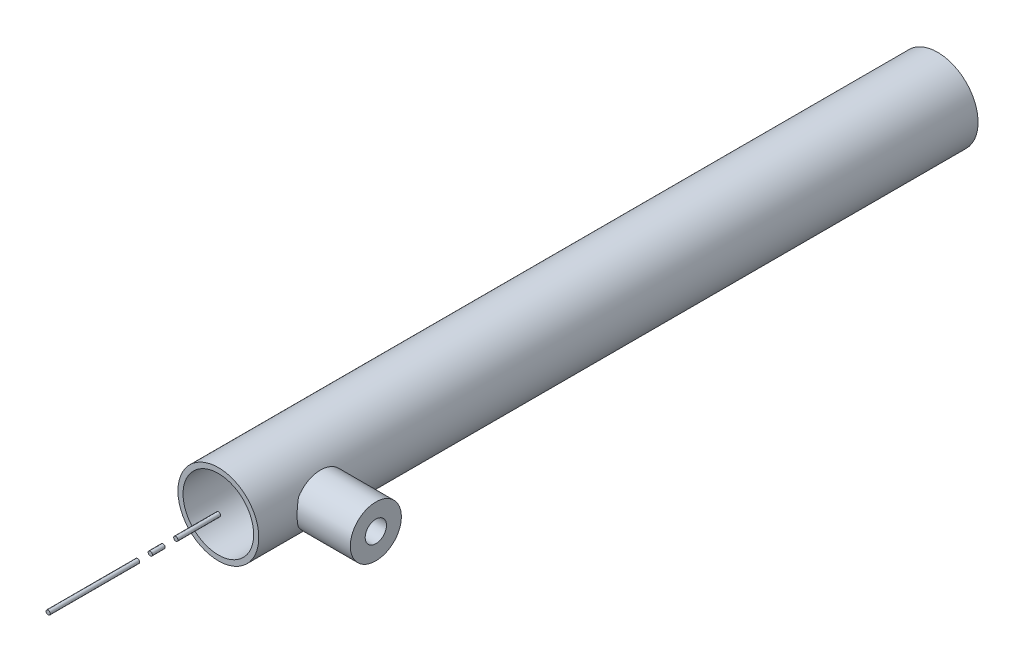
ISO-10303-21;
HEADER;
FILE_DESCRIPTION(('STEP AP214'),'2;1');
FILE_NAME('part.step','',(''),(''),'','','');
FILE_SCHEMA(('AUTOMOTIVE_DESIGN { 1 0 10303 214 1 1 1 1 }'));
ENDSEC;
DATA;
#1=APPLICATION_CONTEXT('core data for automotive mechanical design processes');
#2=APPLICATION_PROTOCOL_DEFINITION('international standard','automotive_design',2000,#1);
#3=PRODUCT_CONTEXT('',#1,'mechanical');
#4=PRODUCT('Part','Part','',(#3));
#5=PRODUCT_RELATED_PRODUCT_CATEGORY('part','',(#4));
#6=PRODUCT_DEFINITION_FORMATION('','',#4);
#7=PRODUCT_DEFINITION_CONTEXT('part definition',#1,'design');
#8=PRODUCT_DEFINITION('design','',#6,#7);
#9=PRODUCT_DEFINITION_SHAPE('','',#8);
#10=(LENGTH_UNIT() NAMED_UNIT(*) SI_UNIT(.MILLI.,.METRE.));
#11=(NAMED_UNIT(*) PLANE_ANGLE_UNIT() SI_UNIT($,.RADIAN.));
#12=(NAMED_UNIT(*) SI_UNIT($,.STERADIAN.) SOLID_ANGLE_UNIT());
#13=UNCERTAINTY_MEASURE_WITH_UNIT(LENGTH_MEASURE(1.E-05),#10,'distance_accuracy_value','');
#14=(GEOMETRIC_REPRESENTATION_CONTEXT(3) GLOBAL_UNCERTAINTY_ASSIGNED_CONTEXT((#13)) GLOBAL_UNIT_ASSIGNED_CONTEXT((#10,
#11,#12)) REPRESENTATION_CONTEXT('',''));
#15=CARTESIAN_POINT('',(0.,0.,0.));
#16=DIRECTION('',(0.,0.,1.));
#17=DIRECTION('',(1.,0.,0.));
#18=AXIS2_PLACEMENT_3D('',#15,#16,#17);
#19=CARTESIAN_POINT('',(0.,0.,209.));
#20=DIRECTION('',(0.,0.,-1.));
#21=DIRECTION('',(-1.,0.,0.));
#22=AXIS2_PLACEMENT_3D('',#19,#20,#21);
#23=CYLINDRICAL_SURFACE('',#22,0.5);
#24=CARTESIAN_POINT('',(0.,0.,179.));
#25=DIRECTION('',(0.,0.,-1.));
#26=DIRECTION('',(-1.,0.,0.));
#27=AXIS2_PLACEMENT_3D('',#24,#25,#26);
#28=CIRCLE('',#27,0.5);
#29=CARTESIAN_POINT('',(-0.5,0.,179.));
#30=VERTEX_POINT('',#29);
#31=EDGE_CURVE('E50',#30,#30,#28,.T.);
#32=ORIENTED_EDGE('',*,*,#31,.T.);
#33=EDGE_LOOP('',(#32));
#34=FACE_BOUND('',#33,.T.);
#35=CARTESIAN_POINT('',(0.,0.,169.));
#36=DIRECTION('',(0.,0.,1.));
#37=DIRECTION('',(1.,0.,0.));
#38=AXIS2_PLACEMENT_3D('',#35,#36,#37);
#39=CIRCLE('',#38,0.5);
#40=CARTESIAN_POINT('',(0.5,0.,169.));
#41=VERTEX_POINT('',#40);
#42=EDGE_CURVE('E11',#41,#41,#39,.T.);
#43=ORIENTED_EDGE('',*,*,#42,.T.);
#44=EDGE_LOOP('',(#43));
#45=FACE_BOUND('',#44,.T.);
#46=ADVANCED_FACE('F44',(#34,#45),#23,.T.);
#47=CARTESIAN_POINT('',(0.,0.,169.));
#48=DIRECTION('',(0.,0.,1.));
#49=DIRECTION('',(1.,0.,0.));
#50=AXIS2_PLACEMENT_3D('',#47,#48,#49);
#51=PLANE('',#50);
#52=ORIENTED_EDGE('',*,*,#42,.F.);
#53=EDGE_LOOP('',(#52));
#54=FACE_BOUND('',#53,.T.);
#55=ADVANCED_FACE('F59',(#54),#51,.F.);
#56=CARTESIAN_POINT('',(-2.75025332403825,-4.5,179.));
#57=DIRECTION('',(0.,0.,-1.));
#58=DIRECTION('',(-1.,0.,0.));
#59=AXIS2_PLACEMENT_3D('',#56,#57,#58);
#60=PLANE('',#59);
#61=ORIENTED_EDGE('',*,*,#31,.F.);
#62=EDGE_LOOP('',(#61));
#63=FACE_BOUND('',#62,.T.);
#64=ADVANCED_FACE('F57',(#63),#60,.F.);
#65=CLOSED_SHELL('',(#46,#55,#64));
#66=MANIFOLD_SOLID_BREP('B2_NOT_SHOWN',#65);
#67=CARTESIAN_POINT('',(0.,0.,209.));
#68=DIRECTION('',(0.,0.,1.));
#69=DIRECTION('',(1.,0.,0.));
#70=AXIS2_PLACEMENT_3D('',#67,#68,#69);
#71=PLANE('',#70);
#72=CARTESIAN_POINT('',(0.,0.,209.));
#73=DIRECTION('',(0.,0.,1.));
#74=DIRECTION('',(1.,0.,0.));
#75=AXIS2_PLACEMENT_3D('',#72,#73,#74);
#76=CIRCLE('',#75,0.5);
#77=CARTESIAN_POINT('',(0.5,0.,209.));
#78=VERTEX_POINT('',#77);
#79=EDGE_CURVE('E97',#78,#78,#76,.T.);
#80=ORIENTED_EDGE('',*,*,#79,.T.);
#81=EDGE_LOOP('',(#80));
#82=FACE_BOUND('',#81,.T.);
#83=ADVANCED_FACE('F93',(#82),#71,.T.);
#84=CARTESIAN_POINT('',(0.,0.,209.));
#85=DIRECTION('',(0.,0.,-1.));
#86=DIRECTION('',(-1.,0.,0.));
#87=AXIS2_PLACEMENT_3D('',#84,#85,#86);
#88=CYLINDRICAL_SURFACE('',#87,0.5);
#89=CARTESIAN_POINT('',(0.,0.,188.));
#90=DIRECTION('',(0.,0.,1.));
#91=DIRECTION('',(1.,0.,0.));
#92=AXIS2_PLACEMENT_3D('',#89,#90,#91);
#93=CIRCLE('',#92,0.5);
#94=CARTESIAN_POINT('',(0.5,0.,188.));
#95=VERTEX_POINT('',#94);
#96=EDGE_CURVE('E43',#95,#95,#93,.T.);
#97=ORIENTED_EDGE('',*,*,#96,.T.);
#98=EDGE_LOOP('',(#97));
#99=FACE_BOUND('',#98,.T.);
#100=ORIENTED_EDGE('',*,*,#79,.F.);
#101=EDGE_LOOP('',(#100));
#102=FACE_BOUND('',#101,.T.);
#103=ADVANCED_FACE('F95',(#99,#102),#88,.T.);
#104=CARTESIAN_POINT('',(-2.75025332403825,-4.5,188.));
#105=DIRECTION('',(0.,0.,1.));
#106=DIRECTION('',(1.,0.,0.));
#107=AXIS2_PLACEMENT_3D('',#104,#105,#106);
#108=PLANE('',#107);
#109=ORIENTED_EDGE('',*,*,#96,.F.);
#110=EDGE_LOOP('',(#109));
#111=FACE_BOUND('',#110,.T.);
#112=ADVANCED_FACE('F108',(#111),#108,.F.);
#113=CLOSED_SHELL('',(#83,#103,#112));
#114=MANIFOLD_SOLID_BREP('B6_NOT_SHOWN',#113);
#115=CARTESIAN_POINT('',(0.,0.,209.));
#116=DIRECTION('',(0.,0.,-1.));
#117=DIRECTION('',(-1.,0.,0.));
#118=AXIS2_PLACEMENT_3D('',#115,#116,#117);
#119=CYLINDRICAL_SURFACE('',#118,0.5);
#120=CARTESIAN_POINT('',(0.,0.,182.));
#121=DIRECTION('',(0.,0.,1.));
#122=DIRECTION('',(1.,0.,0.));
#123=AXIS2_PLACEMENT_3D('',#120,#121,#122);
#124=CIRCLE('',#123,0.5);
#125=CARTESIAN_POINT('',(0.5,0.,182.));
#126=VERTEX_POINT('',#125);
#127=EDGE_CURVE('E92',#126,#126,#124,.T.);
#128=ORIENTED_EDGE('',*,*,#127,.T.);
#129=EDGE_LOOP('',(#128));
#130=FACE_BOUND('',#129,.T.);
#131=CARTESIAN_POINT('',(0.,0.,185.));
#132=DIRECTION('',(0.,0.,-1.));
#133=DIRECTION('',(-1.,0.,0.));
#134=AXIS2_PLACEMENT_3D('',#131,#132,#133);
#135=CIRCLE('',#134,0.5);
#136=CARTESIAN_POINT('',(-0.5,0.,185.));
#137=VERTEX_POINT('',#136);
#138=EDGE_CURVE('E149',#137,#137,#135,.T.);
#139=ORIENTED_EDGE('',*,*,#138,.T.);
#140=EDGE_LOOP('',(#139));
#141=FACE_BOUND('',#140,.T.);
#142=ADVANCED_FACE('F143',(#130,#141),#119,.T.);
#143=CARTESIAN_POINT('',(-2.75025332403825,-4.5,185.));
#144=DIRECTION('',(0.,0.,-1.));
#145=DIRECTION('',(-1.,0.,0.));
#146=AXIS2_PLACEMENT_3D('',#143,#144,#145);
#147=PLANE('',#146);
#148=ORIENTED_EDGE('',*,*,#138,.F.);
#149=EDGE_LOOP('',(#148));
#150=FACE_BOUND('',#149,.T.);
#151=ADVANCED_FACE('F156',(#150),#147,.F.);
#152=CARTESIAN_POINT('',(-2.75025332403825,-4.5,182.));
#153=DIRECTION('',(0.,0.,1.));
#154=DIRECTION('',(1.,0.,0.));
#155=AXIS2_PLACEMENT_3D('',#152,#153,#154);
#156=PLANE('',#155);
#157=ORIENTED_EDGE('',*,*,#127,.F.);
#158=EDGE_LOOP('',(#157));
#159=FACE_BOUND('',#158,.T.);
#160=ADVANCED_FACE('F158',(#159),#156,.F.);
#161=CLOSED_SHELL('',(#142,#151,#160));
#162=MANIFOLD_SOLID_BREP('B38_NOT_SHOWN',#161);
#163=CARTESIAN_POINT('',(0.,0.,169.));
#164=DIRECTION('',(0.,0.,-1.));
#165=DIRECTION('',(-1.,0.,0.));
#166=AXIS2_PLACEMENT_3D('',#163,#164,#165);
#167=CYLINDRICAL_SURFACE('',#166,9.5);
#168=DIRECTION('',(0.,0.,-1.));
#169=VECTOR('',#168,1.);
#170=CARTESIAN_POINT('',(9.,3.0413812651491,169.));
#171=LINE('',#170,#169);
#172=CARTESIAN_POINT('',(9.,3.0413812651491,148.827959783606));
#173=VERTEX_POINT('',#172);
#174=CARTESIAN_POINT('',(9.,3.0413812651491,159.172040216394));
#175=VERTEX_POINT('',#174);
#176=EDGE_CURVE('E141',#173,#175,#171,.F.);
#177=ORIENTED_EDGE('',*,*,#176,.F.);
#178=CARTESIAN_POINT('',(9.5,0.,148.));
#179=CARTESIAN_POINT('',(9.50000010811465,0.152217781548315,147.999999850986));
#180=CARTESIAN_POINT('',(9.49633375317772,0.304435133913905,148.005799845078));
#181=CARTESIAN_POINT('',(9.4817591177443,0.60770026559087,148.028916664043));
#182=CARTESIAN_POINT('',(9.47084798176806,0.75874755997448,148.04623802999));
#183=CARTESIAN_POINT('',(9.44203490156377,1.05862998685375,148.092179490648));
#184=CARTESIAN_POINT('',(9.42412404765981,1.20746204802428,148.120813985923));
#185=CARTESIAN_POINT('',(9.3817371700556,1.50170458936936,148.189001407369));
#186=CARTESIAN_POINT('',(9.35725837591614,1.64711359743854,148.22855894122));
#187=CARTESIAN_POINT('',(9.30244841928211,1.93273877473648,148.317853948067));
#188=CARTESIAN_POINT('',(9.27214973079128,2.07297883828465,148.367535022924));
#189=CARTESIAN_POINT('',(9.20626725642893,2.3483451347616,148.47666404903));
#190=CARTESIAN_POINT('',(9.17068142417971,2.48346936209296,148.536115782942));
#191=CARTESIAN_POINT('',(9.05709355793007,2.88000891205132,148.72821865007));
#192=CARTESIAN_POINT('',(8.97219907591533,3.13290208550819,148.874716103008));
#193=CARTESIAN_POINT('',(8.783041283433,3.63111253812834,149.21323652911));
#194=CARTESIAN_POINT('',(8.6777677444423,3.87417114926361,149.407979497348));
#195=CARTESIAN_POINT('',(8.46135089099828,4.32647591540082,149.831347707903));
#196=CARTESIAN_POINT('',(8.35019973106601,4.53567528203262,150.060019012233));
#197=CARTESIAN_POINT('',(8.17856798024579,4.83495322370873,150.442710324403));
#198=CARTESIAN_POINT('',(8.11685476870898,4.93756753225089,150.58653854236));
#199=CARTESIAN_POINT('',(7.99647413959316,5.13023418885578,150.883578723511));
#200=CARTESIAN_POINT('',(7.93780731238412,5.2202841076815,151.036792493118));
#201=CARTESIAN_POINT('',(7.76961839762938,5.47021291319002,151.509346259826));
#202=CARTESIAN_POINT('',(7.66754741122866,5.6104689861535,151.84235859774));
#203=CARTESIAN_POINT('',(7.52371459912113,5.80122342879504,152.445149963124));
#204=CARTESIAN_POINT('',(7.47314531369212,5.86564200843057,152.708416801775));
#205=CARTESIAN_POINT('',(7.41777531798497,5.93526905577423,153.110546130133));
#206=CARTESIAN_POINT('',(7.40273392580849,5.95397654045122,153.245757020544));
#207=CARTESIAN_POINT('',(7.37998709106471,5.98215178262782,153.517780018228));
#208=CARTESIAN_POINT('',(7.37228174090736,5.99161942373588,153.65459214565));
#209=CARTESIAN_POINT('',(7.36451814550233,6.00115878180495,153.929149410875));
#210=CARTESIAN_POINT('',(7.36448173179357,6.00120367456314,154.066896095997));
#211=CARTESIAN_POINT('',(7.37210788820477,5.9918329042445,154.341850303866));
#212=CARTESIAN_POINT('',(7.37977049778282,5.98241719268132,154.479057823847));
#213=CARTESIAN_POINT('',(7.40249633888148,5.95427360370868,154.75196322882));
#214=CARTESIAN_POINT('',(7.41756331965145,5.93554100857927,154.887660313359));
#215=CARTESIAN_POINT('',(7.45452147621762,5.8890559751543,155.15657700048));
#216=CARTESIAN_POINT('',(7.47641548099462,5.86129979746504,155.289795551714));
#217=CARTESIAN_POINT('',(7.54991409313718,5.7667247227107,155.677590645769));
#218=CARTESIAN_POINT('',(7.61002830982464,5.68779576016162,155.927715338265));
#219=CARTESIAN_POINT('',(7.74669199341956,5.50019518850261,156.411507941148));
#220=CARTESIAN_POINT('',(7.82324722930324,5.3915131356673,156.645170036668));
#221=CARTESIAN_POINT('',(8.00169167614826,5.12381265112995,157.136721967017));
#222=CARTESIAN_POINT('',(8.10563157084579,4.95915584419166,157.390794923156));
#223=CARTESIAN_POINT('',(8.31776462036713,4.59448521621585,157.870605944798));
#224=CARTESIAN_POINT('',(8.42596211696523,4.39443453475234,158.096314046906));
#225=CARTESIAN_POINT('',(8.59404594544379,4.05122338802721,158.429317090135));
#226=CARTESIAN_POINT('',(8.65542053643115,3.91871375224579,158.54700276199));
#227=CARTESIAN_POINT('',(8.77504636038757,3.64295430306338,158.770785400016));
#228=CARTESIAN_POINT('',(8.83329861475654,3.49970803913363,158.876886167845));
#229=CARTESIAN_POINT('',(8.94514093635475,3.20305908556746,159.076651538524));
#230=CARTESIAN_POINT('',(8.99873081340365,3.04965598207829,159.170315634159));
#231=CARTESIAN_POINT('',(9.09975776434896,2.73348427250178,159.344211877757));
#232=CARTESIAN_POINT('',(9.14719555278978,2.57071675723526,159.424445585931));
#233=CARTESIAN_POINT('',(9.23229511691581,2.24533967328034,159.566718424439));
#234=CARTESIAN_POINT('',(9.2703311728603,2.08314238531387,159.629474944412));
#235=CARTESIAN_POINT('',(9.33849690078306,1.75241725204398,159.741034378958));
#236=CARTESIAN_POINT('',(9.36862797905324,1.58389053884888,159.789839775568));
#237=CARTESIAN_POINT('',(9.42003064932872,1.24211494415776,159.872651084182));
#238=CARTESIAN_POINT('',(9.44131237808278,1.06887170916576,159.906673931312));
#239=CARTESIAN_POINT('',(9.47436560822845,0.719179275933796,159.959364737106));
#240=CARTESIAN_POINT('',(9.48613881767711,0.542730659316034,159.978035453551));
#241=CARTESIAN_POINT('',(9.49874799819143,0.215417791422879,159.998021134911));
#242=CARTESIAN_POINT('',(9.50097312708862,0.0647364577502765,160.00154075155));
#243=CARTESIAN_POINT('',(9.49825142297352,-0.23639454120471,159.997231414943));
#244=CARTESIAN_POINT('',(9.49330513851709,-0.386844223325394,159.989403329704));
#245=CARTESIAN_POINT('',(9.4763635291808,-0.686314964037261,159.962514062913));
#246=CARTESIAN_POINT('',(9.46436888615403,-0.835336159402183,159.943453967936));
#247=CARTESIAN_POINT('',(9.43362340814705,-1.13084980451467,159.89437153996));
#248=CARTESIAN_POINT('',(9.41487247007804,-1.27734221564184,159.864349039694));
#249=CARTESIAN_POINT('',(9.37201044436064,-1.56045122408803,159.795280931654));
#250=CARTESIAN_POINT('',(9.34816972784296,-1.69721950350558,159.756687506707));
#251=CARTESIAN_POINT('',(9.29519876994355,-1.96676890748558,159.670262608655));
#252=CARTESIAN_POINT('',(9.26606684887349,-2.09954875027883,159.6224282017));
#253=CARTESIAN_POINT('',(9.17157110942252,-2.49080088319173,159.465776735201));
#254=CARTESIAN_POINT('',(9.0990731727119,-2.7424026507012,159.343757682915));
#255=CARTESIAN_POINT('',(8.93226861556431,-3.24686905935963,159.054771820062));
#256=CARTESIAN_POINT('',(8.83650784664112,-3.49735561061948,158.884535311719));
#257=CARTESIAN_POINT('',(8.63544667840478,-3.96795116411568,158.510633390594));
#258=CARTESIAN_POINT('',(8.53013596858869,-4.18802667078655,158.30693165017));
#259=CARTESIAN_POINT('',(8.30205991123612,-4.62550427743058,157.837002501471));
#260=CARTESIAN_POINT('',(8.17902776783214,-4.837642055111,157.565981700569));
#261=CARTESIAN_POINT('',(7.94419392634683,-5.21430910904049,156.988274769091));
#262=CARTESIAN_POINT('',(7.83238571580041,-5.37886609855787,156.681609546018));
#263=CARTESIAN_POINT('',(7.65604126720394,-5.62612217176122,156.103323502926));
#264=CARTESIAN_POINT('',(7.58651135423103,-5.71870492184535,155.837523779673));
#265=CARTESIAN_POINT('',(7.50132816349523,-5.82942627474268,155.427538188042));
#266=CARTESIAN_POINT('',(7.47612250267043,-5.8616372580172,155.289027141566));
#267=CARTESIAN_POINT('',(7.43296645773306,-5.91626859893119,155.009001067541));
#268=CARTESIAN_POINT('',(7.41501288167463,-5.93869326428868,154.867487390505));
#269=CARTESIAN_POINT('',(7.38699822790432,-5.97350498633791,154.581489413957));
#270=CARTESIAN_POINT('',(7.37699022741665,-5.98582455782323,154.436991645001));
#271=CARTESIAN_POINT('',(7.36550647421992,-5.99994996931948,154.147139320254));
#272=CARTESIAN_POINT('',(7.36403066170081,-6.00175588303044,154.001784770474));
#273=CARTESIAN_POINT('',(7.36967985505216,-5.99481756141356,153.711465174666));
#274=CARTESIAN_POINT('',(7.37680686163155,-5.98607087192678,153.566500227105));
#275=CARTESIAN_POINT('',(7.39934409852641,-5.95818979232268,153.278234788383));
#276=CARTESIAN_POINT('',(7.41475415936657,-5.93905561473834,153.13493426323));
#277=CARTESIAN_POINT('',(7.45146544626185,-5.89291479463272,152.863905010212));
#278=CARTESIAN_POINT('',(7.47210979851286,-5.86677407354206,152.735937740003));
#279=CARTESIAN_POINT('',(7.5190426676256,-5.80650086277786,152.482937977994));
#280=CARTESIAN_POINT('',(7.54533305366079,-5.77236572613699,152.35790647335));
#281=CARTESIAN_POINT('',(7.63154021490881,-5.65850486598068,151.988088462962));
#282=CARTESIAN_POINT('',(7.69881089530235,-5.5673022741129,151.748455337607));
#283=CARTESIAN_POINT('',(7.85684965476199,-5.34240603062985,151.253586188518));
#284=CARTESIAN_POINT('',(7.94959362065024,-5.204533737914,151.00091616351));
#285=CARTESIAN_POINT('',(8.14331597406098,-4.8958752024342,150.51975214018));
#286=CARTESIAN_POINT('',(8.24430082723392,-4.72506296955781,150.291277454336));
#287=CARTESIAN_POINT('',(8.40654417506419,-4.42678450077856,149.946225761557));
#288=CARTESIAN_POINT('',(8.46770458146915,-4.30892491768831,149.82115492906));
#289=CARTESIAN_POINT('',(8.5886238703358,-4.06255402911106,149.58126749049));
#290=CARTESIAN_POINT('',(8.64838314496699,-3.93404575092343,149.466447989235));
#291=CARTESIAN_POINT('',(8.76507300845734,-3.66671373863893,149.247624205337));
#292=CARTESIAN_POINT('',(8.82200103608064,-3.5278809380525,149.143629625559));
#293=CARTESIAN_POINT('',(8.93155295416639,-3.24052513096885,148.94735027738));
#294=CARTESIAN_POINT('',(8.98417637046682,-3.09200106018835,148.855066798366));
#295=CARTESIAN_POINT('',(9.0843277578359,-2.784150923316,148.682101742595));
#296=CARTESIAN_POINT('',(9.1317874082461,-2.62471707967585,148.601571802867));
#297=CARTESIAN_POINT('',(9.21949743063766,-2.29771573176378,148.454495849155));
#298=CARTESIAN_POINT('',(9.25975193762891,-2.13015296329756,148.38794181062));
#299=CARTESIAN_POINT('',(9.33175077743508,-1.78852373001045,148.269925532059));
#300=CARTESIAN_POINT('',(9.36351735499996,-1.61447565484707,148.218423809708));
#301=CARTESIAN_POINT('',(9.41761336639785,-1.26113365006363,148.131216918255));
#302=CARTESIAN_POINT('',(9.43994950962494,-1.08184354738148,148.095500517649));
#303=CARTESIAN_POINT('',(9.4713455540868,-0.752269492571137,148.045448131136));
#304=CARTESIAN_POINT('',(9.48206725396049,-0.60254490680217,148.02842777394));
#305=CARTESIAN_POINT('',(9.49639462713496,-0.301880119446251,148.005703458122));
#306=CARTESIAN_POINT('',(9.49999989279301,-0.150939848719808,148.000000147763));
#307=CARTESIAN_POINT('',(9.5,0.,148.));
#308=B_SPLINE_CURVE_WITH_KNOTS('',3,(#178,#179,#180,#181,#182,#183,#184,#185,#186,#187,#188,
#189,#190,#191,#192,#193,#194,#195,#196,#197,#198,#199,#200,#201,#202,#203,#204,#205,#206,#207,
#208,#209,#210,#211,#212,#213,#214,#215,#216,#217,#218,#219,#220,#221,#222,#223,#224,#225,#226,
#227,#228,#229,#230,#231,#232,#233,#234,#235,#236,#237,#238,#239,#240,#241,#242,#243,#244,#245,
#246,#247,#248,#249,#250,#251,#252,#253,#254,#255,#256,#257,#258,#259,#260,#261,#262,#263,#264,
#265,#266,#267,#268,#269,#270,#271,#272,#273,#274,#275,#276,#277,#278,#279,#280,#281,#282,#283,
#284,#285,#286,#287,#288,#289,#290,#291,#292,#293,#294,#295,#296,#297,#298,#299,#300,#301,#302,
#303,#304,#305,#306,#307),.UNSPECIFIED.,.T.,.F.,(4,2,2,2,2,2,2,2,2,2,2,2,2,2,2,2,2,2,2,2,2,2,2,
2,2,2,2,2,2,2,2,2,2,2,2,2,2,2,2,2,2,2,2,2,2,2,2,2,2,2,2,2,2,2,2,2,2,2,2,2,2,2,2,2,4),(0.,
0.45649935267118,0.913178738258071,1.37044131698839,1.82789707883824,2.28287080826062,
2.73802109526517,3.64733643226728,4.63003970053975,5.61408953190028,6.17491307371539,
6.73584489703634,7.85465230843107,8.67813277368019,9.08965332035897,9.5011790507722,
9.91387627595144,10.3265756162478,10.7394841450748,11.1525640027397,11.9565346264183,
12.7607878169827,13.7176614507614,14.6755375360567,15.2375983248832,15.799474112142,
16.3613728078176,16.923206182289,17.4564895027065,17.9896778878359,18.5222538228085,
19.0547340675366,19.5063709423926,19.9579732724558,20.4095319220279,20.8610974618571,
21.2929086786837,21.7248572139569,22.5880835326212,23.5374274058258,24.487808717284,
25.5795193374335,26.6705928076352,27.536587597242,27.9693939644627,28.4020096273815,
28.8374914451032,29.2729702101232,29.7085502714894,30.1441214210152,30.5403983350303,
30.9368066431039,31.7292483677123,32.6334527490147,33.5383735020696,34.0850876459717,
34.6316468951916,35.178691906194,35.7257970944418,36.2794328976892,36.8327499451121,
37.3846023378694,37.9360614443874,38.3887023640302,38.8413692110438),.UNSPECIFIED.);
#309=CARTESIAN_POINT('',(9.,-3.0413812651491,148.827959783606));
#310=VERTEX_POINT('',#309);
#311=EDGE_CURVE('E205',#310,#173,#308,.T.);
#312=ORIENTED_EDGE('',*,*,#311,.F.);
#313=DIRECTION('',(0.,0.,-1.));
#314=VECTOR('',#313,1.);
#315=CARTESIAN_POINT('',(9.,-3.0413812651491,169.));
#316=LINE('',#315,#314);
#317=CARTESIAN_POINT('',(9.,-3.0413812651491,159.172040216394));
#318=VERTEX_POINT('',#317);
#319=EDGE_CURVE('E208',#318,#310,#316,.T.);
#320=ORIENTED_EDGE('',*,*,#319,.F.);
#321=EDGE_CURVE('E192',#175,#318,#308,.T.);
#322=ORIENTED_EDGE('',*,*,#321,.F.);
#323=EDGE_LOOP('',(#177,#312,#320,#322));
#324=FACE_BOUND('',#323,.T.);
#325=CARTESIAN_POINT('',(0.,0.,169.));
#326=DIRECTION('',(0.,0.,-1.));
#327=DIRECTION('',(-1.,0.,0.));
#328=AXIS2_PLACEMENT_3D('',#325,#326,#327);
#329=CIRCLE('',#328,9.5);
#330=CARTESIAN_POINT('',(-9.5,0.,169.));
#331=VERTEX_POINT('',#330);
#332=EDGE_CURVE('E217',#331,#331,#329,.T.);
#333=ORIENTED_EDGE('',*,*,#332,.T.);
#334=EDGE_LOOP('',(#333));
#335=FACE_BOUND('',#334,.T.);
#336=CARTESIAN_POINT('',(0.,0.,0.));
#337=DIRECTION('',(0.,0.,-1.));
#338=DIRECTION('',(-1.,0.,0.));
#339=AXIS2_PLACEMENT_3D('',#336,#337,#338);
#340=CIRCLE('',#339,9.5);
#341=CARTESIAN_POINT('',(-9.5,0.,0.));
#342=VERTEX_POINT('',#341);
#343=EDGE_CURVE('E224',#342,#342,#340,.T.);
#344=ORIENTED_EDGE('',*,*,#343,.F.);
#345=EDGE_LOOP('',(#344));
#346=FACE_BOUND('',#345,.T.);
#347=ADVANCED_FACE('F184',(#324,#335,#346),#167,.T.);
#348=CARTESIAN_POINT('',(9.5,0.,169.));
#349=DIRECTION('',(0.,0.,1.));
#350=DIRECTION('',(1.,0.,0.));
#351=AXIS2_PLACEMENT_3D('',#348,#349,#350);
#352=PLANE('',#351);
#353=CARTESIAN_POINT('',(0.,0.,169.));
#354=DIRECTION('',(0.,0.,1.));
#355=DIRECTION('',(1.,0.,0.));
#356=AXIS2_PLACEMENT_3D('',#353,#354,#355);
#357=CIRCLE('',#356,8.29999999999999);
#358=CARTESIAN_POINT('',(8.29999999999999,0.,169.));
#359=VERTEX_POINT('',#358);
#360=EDGE_CURVE('E255',#359,#359,#357,.T.);
#361=ORIENTED_EDGE('',*,*,#360,.F.);
#362=EDGE_LOOP('',(#361));
#363=FACE_BOUND('',#362,.T.);
#364=ORIENTED_EDGE('',*,*,#332,.F.);
#365=EDGE_LOOP('',(#364));
#366=FACE_BOUND('',#365,.T.);
#367=ADVANCED_FACE('F245',(#363,#366),#352,.T.);
#368=CARTESIAN_POINT('',(0.,0.,0.));
#369=DIRECTION('',(0.,0.,-1.));
#370=DIRECTION('',(-1.,0.,0.));
#371=AXIS2_PLACEMENT_3D('',#368,#369,#370);
#372=PLANE('',#371);
#373=CARTESIAN_POINT('',(0.,0.,0.));
#374=DIRECTION('',(0.,0.,1.));
#375=DIRECTION('',(1.,0.,0.));
#376=AXIS2_PLACEMENT_3D('',#373,#374,#375);
#377=CIRCLE('',#376,8.29999999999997);
#378=CARTESIAN_POINT('',(8.29999999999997,0.,0.));
#379=VERTEX_POINT('',#378);
#380=EDGE_CURVE('E226',#379,#379,#377,.T.);
#381=ORIENTED_EDGE('',*,*,#380,.T.);
#382=EDGE_LOOP('',(#381));
#383=FACE_BOUND('',#382,.T.);
#384=ORIENTED_EDGE('',*,*,#343,.T.);
#385=EDGE_LOOP('',(#384));
#386=FACE_BOUND('',#385,.T.);
#387=ADVANCED_FACE('F243',(#383,#386),#372,.T.);
#388=CARTESIAN_POINT('',(9.,-3.04138126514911,148.827959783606));
#389=DIRECTION('',(-1.,0.,0.));
#390=DIRECTION('',(0.,0.,1.));
#391=AXIS2_PLACEMENT_3D('',#388,#389,#390);
#392=PLANE('',#391);
#393=CARTESIAN_POINT('',(9.,0.,154.));
#394=DIRECTION('',(1.,0.,0.));
#395=DIRECTION('',(0.,0.,-1.));
#396=AXIS2_PLACEMENT_3D('',#393,#394,#395);
#397=CIRCLE('',#396,6.00000000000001);
#398=EDGE_CURVE('E221',#173,#175,#397,.T.);
#399=ORIENTED_EDGE('',*,*,#398,.F.);
#400=ORIENTED_EDGE('',*,*,#176,.T.);
#401=EDGE_LOOP('',(#399,#400));
#402=FACE_BOUND('',#401,.T.);
#403=ADVANCED_FACE('F241',(#402),#392,.T.);
#404=CARTESIAN_POINT('',(9.,0.,154.));
#405=DIRECTION('',(1.,0.,0.));
#406=DIRECTION('',(0.,0.,-1.));
#407=AXIS2_PLACEMENT_3D('',#404,#405,#406);
#408=CYLINDRICAL_SURFACE('',#407,6.00000000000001);
#409=ORIENTED_EDGE('',*,*,#398,.T.);
#410=ORIENTED_EDGE('',*,*,#321,.T.);
#411=EDGE_CURVE('E216',#318,#310,#397,.T.);
#412=ORIENTED_EDGE('',*,*,#411,.T.);
#413=ORIENTED_EDGE('',*,*,#311,.T.);
#414=EDGE_LOOP('',(#409,#410,#412,#413));
#415=FACE_BOUND('',#414,.T.);
#416=CARTESIAN_POINT('',(22.,0.,154.));
#417=DIRECTION('',(1.,0.,0.));
#418=DIRECTION('',(0.,0.,-1.));
#419=AXIS2_PLACEMENT_3D('',#416,#417,#418);
#420=CIRCLE('',#419,6.00000000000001);
#421=CARTESIAN_POINT('',(22.,0.,148.));
#422=VERTEX_POINT('',#421);
#423=EDGE_CURVE('E222',#422,#422,#420,.T.);
#424=ORIENTED_EDGE('',*,*,#423,.F.);
#425=EDGE_LOOP('',(#424));
#426=FACE_BOUND('',#425,.T.);
#427=ADVANCED_FACE('F219',(#415,#426),#408,.T.);
#428=ORIENTED_EDGE('',*,*,#411,.F.);
#429=ORIENTED_EDGE('',*,*,#319,.T.);
#430=EDGE_LOOP('',(#428,#429));
#431=FACE_BOUND('',#430,.T.);
#432=ADVANCED_FACE('F215',(#431),#392,.T.);
#433=CARTESIAN_POINT('',(22.,0.,154.));
#434=DIRECTION('',(1.,0.,0.));
#435=DIRECTION('',(0.,0.,-1.));
#436=AXIS2_PLACEMENT_3D('',#433,#434,#435);
#437=PLANE('',#436);
#438=CARTESIAN_POINT('',(22.,0.,154.));
#439=DIRECTION('',(1.,0.,0.));
#440=DIRECTION('',(0.,0.,-1.));
#441=AXIS2_PLACEMENT_3D('',#438,#439,#440);
#442=CIRCLE('',#441,2.49999999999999);
#443=CARTESIAN_POINT('',(22.,0.,151.5));
#444=VERTEX_POINT('',#443);
#445=EDGE_CURVE('E265',#444,#444,#442,.T.);
#446=ORIENTED_EDGE('',*,*,#445,.F.);
#447=EDGE_LOOP('',(#446));
#448=FACE_BOUND('',#447,.T.);
#449=ORIENTED_EDGE('',*,*,#423,.T.);
#450=EDGE_LOOP('',(#449));
#451=FACE_BOUND('',#450,.T.);
#452=ADVANCED_FACE('F273',(#448,#451),#437,.T.);
#453=CARTESIAN_POINT('',(0.,0.,169.));
#454=DIRECTION('',(0.,0.,1.));
#455=DIRECTION('',(1.,0.,0.));
#456=AXIS2_PLACEMENT_3D('',#453,#454,#455);
#457=CYLINDRICAL_SURFACE('',#456,8.29999999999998);
#458=ORIENTED_EDGE('',*,*,#380,.F.);
#459=EDGE_LOOP('',(#458));
#460=FACE_BOUND('',#459,.T.);
#461=ORIENTED_EDGE('',*,*,#360,.T.);
#462=EDGE_LOOP('',(#461));
#463=FACE_BOUND('',#462,.T.);
#464=ADVANCED_FACE('F276',(#460,#463),#457,.F.);
#465=CARTESIAN_POINT('',(9.00000000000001,0.,154.));
#466=DIRECTION('',(-1.,0.,0.));
#467=DIRECTION('',(0.,0.,1.));
#468=AXIS2_PLACEMENT_3D('',#465,#466,#467);
#469=PLANE('',#468);
#470=CARTESIAN_POINT('',(9.,0.,154.));
#471=DIRECTION('',(1.,0.,0.));
#472=DIRECTION('',(0.,0.,-1.));
#473=AXIS2_PLACEMENT_3D('',#470,#471,#472);
#474=CIRCLE('',#473,2.49999999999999);
#475=CARTESIAN_POINT('',(9.,0.,151.5));
#476=VERTEX_POINT('',#475);
#477=EDGE_CURVE('E261',#476,#476,#474,.T.);
#478=ORIENTED_EDGE('',*,*,#477,.T.);
#479=EDGE_LOOP('',(#478));
#480=FACE_BOUND('',#479,.T.);
#481=ADVANCED_FACE('F282',(#480),#469,.F.);
#482=CARTESIAN_POINT('',(22.,0.,154.));
#483=DIRECTION('',(1.,0.,0.));
#484=DIRECTION('',(0.,0.,-1.));
#485=AXIS2_PLACEMENT_3D('',#482,#483,#484);
#486=CYLINDRICAL_SURFACE('',#485,2.49999999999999);
#487=ORIENTED_EDGE('',*,*,#477,.F.);
#488=EDGE_LOOP('',(#487));
#489=FACE_BOUND('',#488,.T.);
#490=ORIENTED_EDGE('',*,*,#445,.T.);
#491=EDGE_LOOP('',(#490));
#492=FACE_BOUND('',#491,.T.);
#493=ADVANCED_FACE('F271',(#489,#492),#486,.F.);
#494=CLOSED_SHELL('',(#347,#367,#387,#403,#427,#432,#452,#464,#481,#493));
#495=MANIFOLD_SOLID_BREP('B87',#494);
#496=ADVANCED_BREP_SHAPE_REPRESENTATION('',(#18,#66,#114,#162,#495),#14);
#497=SHAPE_DEFINITION_REPRESENTATION(#9,#496);
ENDSEC;
END-ISO-10303-21;
